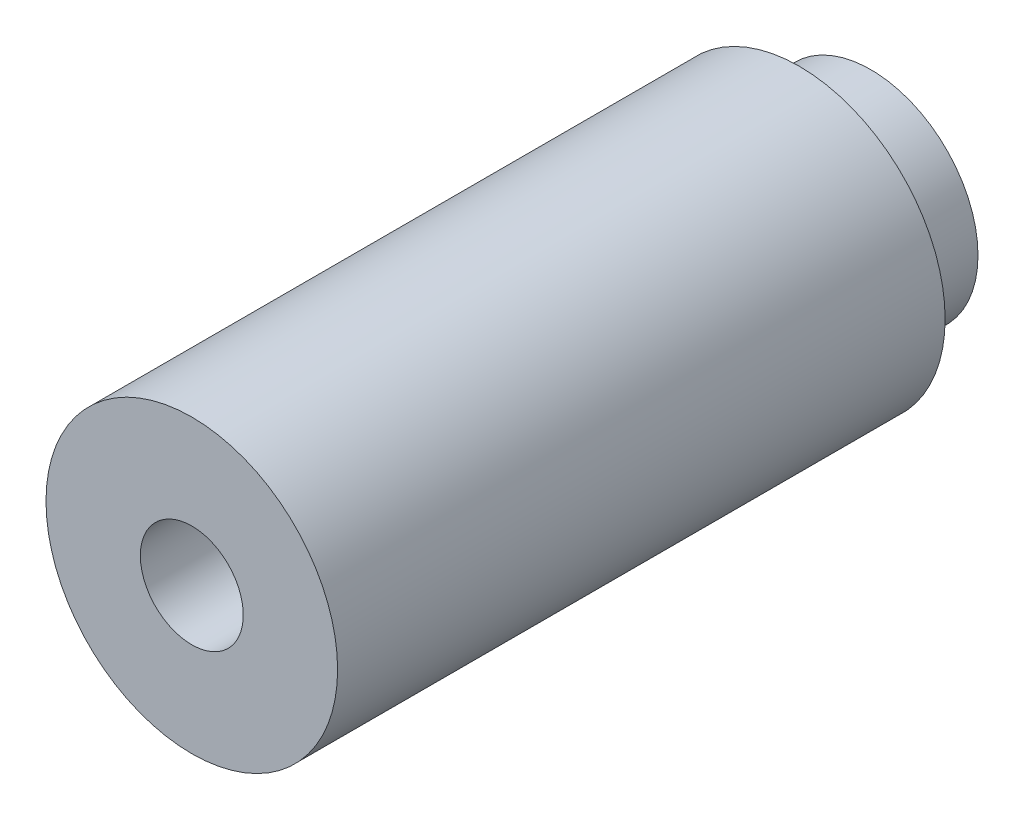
from build123d import *

# Parameters (mm, degrees)
SKETCH2_R           = 12.954
BOSS_EXTRUDE1_DEPTH = 53.975
SKETCH3_R           = 9.525
BOSS_EXTRUDE2_DEPTH = 6.35
SKETCH4_R           = 4.572
CUT_EXTRUDE1_DEPTH  = 64.045363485


with BuildPart() as part:
    # Sketch2 → Boss-Extrude1 (new body)
    with BuildSketch(Plane.XY):
        Circle(SKETCH2_R)
    extrude(amount=BOSS_EXTRUDE1_DEPTH)

    # Sketch3 → Boss-Extrude2 (add)
    with BuildSketch(Plane(origin=(0, 0, 0), x_dir=(-1, 0, 0), z_dir=(0, 0, -1))):
        Circle(SKETCH3_R)
    extrude(amount=BOSS_EXTRUDE2_DEPTH)

    # Sketch4 → Cut-Extrude1 (cut, through all)
    with BuildSketch(Plane(origin=(0, 0, -6.35), x_dir=(-1, 0, 0), z_dir=(0, 0, -1))):
        Circle(SKETCH4_R)
    extrude(amount=-CUT_EXTRUDE1_DEPTH, mode=Mode.SUBTRACT)


solid = part.part
